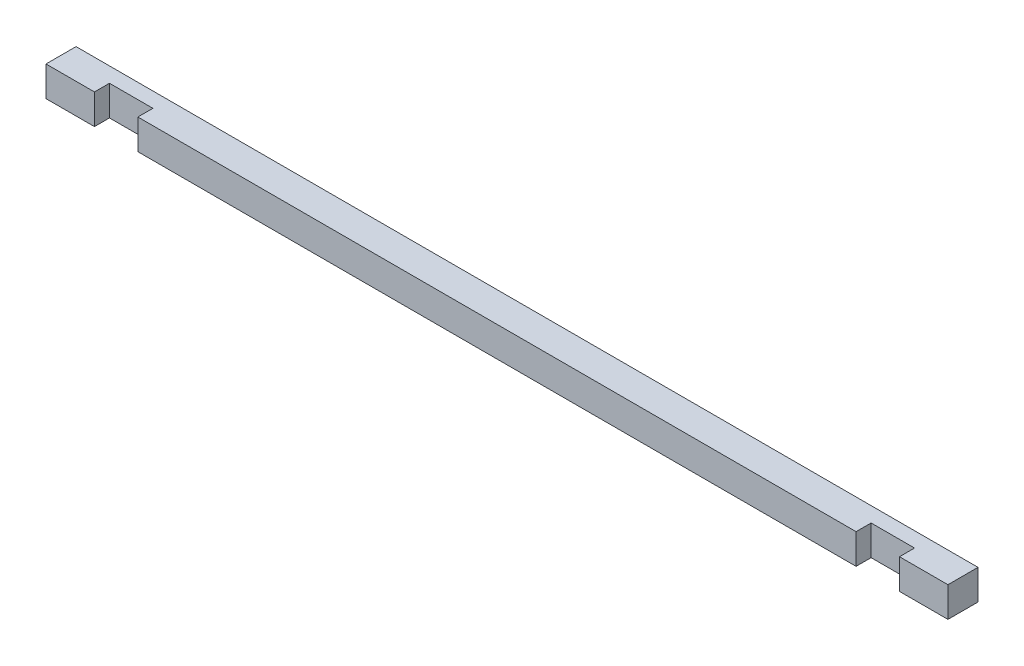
from build123d import *

# Parameters (mm, degrees)
ESQUISSE1_W             = 270
ESQUISSE1_H             = 9
EXTRUSION1_DEPTH        = 9
ESQUISSE2_W             = 13
ESQUISSE2_H             = 9
ENL_V_MAT_EXTRU_1_DEPTH = 4.5


with BuildPart() as part:
    # Esquisse1 → Extrusion1 (new body)
    with BuildSketch(Plane.XY):
        with Locations((135, 4.5)):
            Rectangle(ESQUISSE1_W, ESQUISSE1_H)
    extrude(amount=EXTRUSION1_DEPTH)

    # Esquisse2 → Enl_v. mat.-Extru.1 (cut)
    with BuildSketch(Plane.XY.offset(9)):
        with Locations((21, 4.5)):
            Rectangle(ESQUISSE2_W, ESQUISSE2_H)
        with Locations((249, 4.5)):
            Rectangle(ESQUISSE2_W, ESQUISSE2_H)
    extrude(amount=-ENL_V_MAT_EXTRU_1_DEPTH, mode=Mode.SUBTRACT)


solid = part.part
